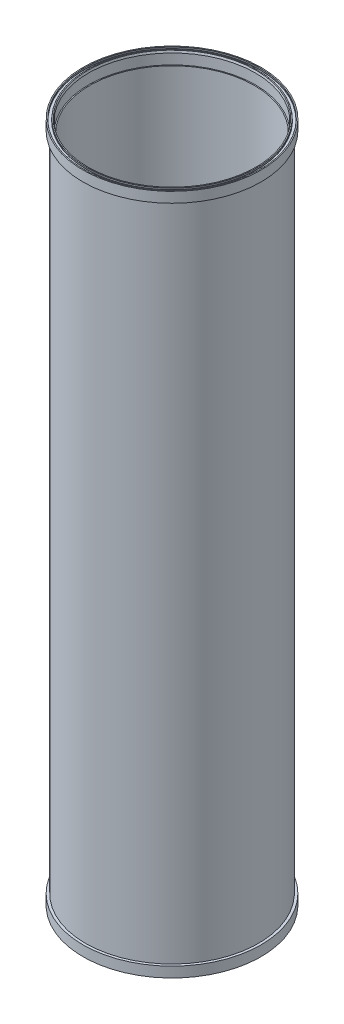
from build123d import *

# Parameters (mm, degrees)
SKETCH4_W = 3.0988
SKETCH4_H = 812.8


with BuildPart() as part:
    # Sketch1 → Revolve1 (revolve)
    with BuildSketch(Plane.XY, mode=Mode.PRIVATE) as revolve1_sk:
        Polygon((-109.5375, 838.2), (-103.309290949, 838.2), (-102.6287, 835.66), (-102.6287, 822.96), (-101.3587, 822.96), (-101.3587, 15.24), (-102.6287, 15.24), (-102.6287, 2.54), (-103.309290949, 0), (-109.5375, 0), align=None)
    revolve(revolve1_sk.sketch.rotate(Axis((0, 0, 0), (0, 1, 0)), 270), axis=Axis((0, 0, 0), (0, 1, 0)))

    # Sketch4 → Cut-Revolve2 (revolve, cut)
    with BuildSketch(Plane.XY, mode=Mode.PRIVATE) as cut_revolve2_sk:
        with Locations((-107.9881, 419.1)):
            Rectangle(SKETCH4_W, SKETCH4_H)
    revolve(cut_revolve2_sk.sketch.rotate(Axis((0, 880.11, 0), (0, -1, 0)), 90), axis=Axis((0, 880.11, 0), (0, -1, 0)), mode=Mode.SUBTRACT)

    # Sketch5 → 2-172 O-Ring (revolve, cut)
    with BuildSketch(Plane.XY, mode=Mode.PRIVATE) as f_2_172_o_ring_sk:
        with BuildLine():
            Line((-108.2675, 838.2), (-104.4829, 838.2))
            ThreePointArc((-104.4829, 838.2), (-104.572702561, 838.162802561), (-104.6099, 838.073))
            Line((-104.6099, 838.073), (-104.6099, 836.4982))
            ThreePointArc((-104.6099, 836.4982), (-104.684294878, 836.318594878), (-104.8639, 836.2442))
            Line((-104.8639, 836.2442), (-107.8865, 836.2442))
            ThreePointArc((-107.8865, 836.2442), (-108.066105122, 836.318594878), (-108.1405, 836.4982))
            Line((-108.1405, 836.4982), (-108.1405, 838.073))
            ThreePointArc((-108.1405, 838.073), (-108.177697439, 838.162802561), (-108.2675, 838.2))
        make_face()
    f_2_172_o_ring = revolve(f_2_172_o_ring_sk.sketch.rotate(Axis((0, 0, 0), (0, 1, 0)), 270), axis=Axis((0, 0, 0), (0, 1, 0)), mode=Mode.SUBTRACT)

    # Mirror1: 2-172 O-Ring across plane
    add(f_2_172_o_ring.mirror(Plane.ZX.offset(419.1)), mode=Mode.SUBTRACT)


solid = part.part
